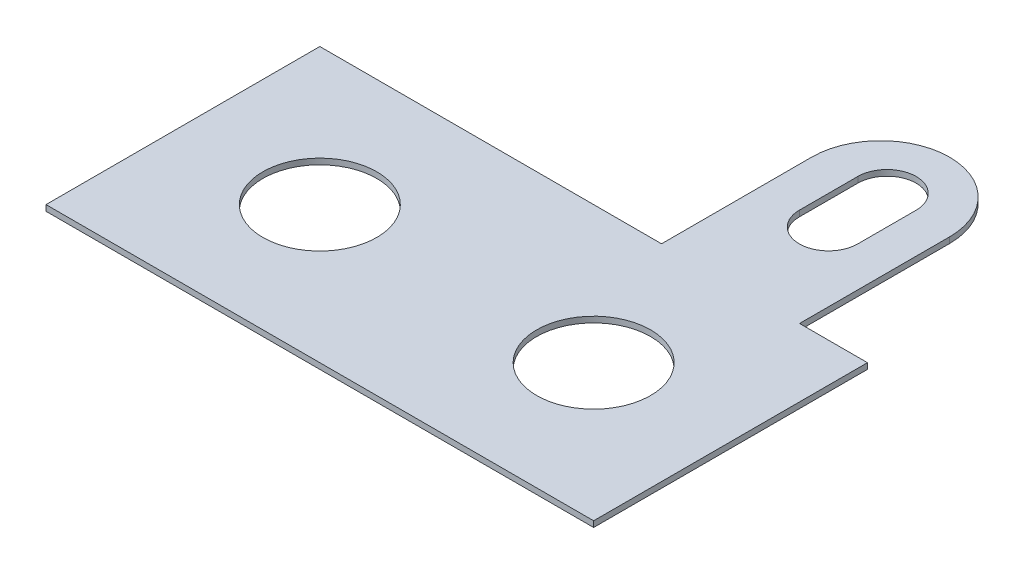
from build123d import *

# Parameters (mm, degrees)
SKETCH1_W           = 19.05
SKETCH1_H           = 9.525
SKETCH1_R           = 1.9812
BOSS_EXTRUDE1_DEPTH = 0.2032
BOSS_EXTRUDE2_DEPTH = 0.2032


with BuildPart() as part:
    # Sketch1 → Boss-Extrude1 (new body)
    with BuildSketch(Plane(origin=(0, 0, 0), x_dir=(1, 0, 0), z_dir=(0, 1, 0))):
        Rectangle(SKETCH1_W, SKETCH1_H)
        with Locations(Location((-4.7625, 0, 0), (0, 0, 270))):
            Circle(SKETCH1_R, mode=Mode.SUBTRACT)
        with Locations(Location((4.7625, 0, 0), (0, 0, 90))):
            Circle(SKETCH1_R, mode=Mode.SUBTRACT)
    extrude(amount=BOSS_EXTRUDE1_DEPTH)

    # Sketch2 → Boss-Extrude2 (add)
    with BuildSketch(Plane.XZ):
        with BuildLine():
            Line((7.1628, -4.7625), (2.3622, -4.7625))
            Line((2.3622, -4.7625), (2.3622, -9.9822))
            ThreePointArc((2.3622, -9.9822), (4.7625, -12.3825), (7.1628, -9.9822))
            Line((7.1628, -9.9822), (7.1628, -4.7625))
        make_face()
        with BuildLine():
            ThreePointArc((5.7785, -10.203712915), (4.7625, -11.219712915), (3.7465, -10.203712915))
            Line((3.7465, -10.203712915), (3.7465, -8.171712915))
            ThreePointArc((3.7465, -8.171712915), (4.7625, -7.155712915), (5.7785, -8.171712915))
            Line((5.7785, -8.171712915), (5.7785, -10.203712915))
        make_face(mode=Mode.SUBTRACT)
    extrude(amount=-BOSS_EXTRUDE2_DEPTH)


solid = part.part
